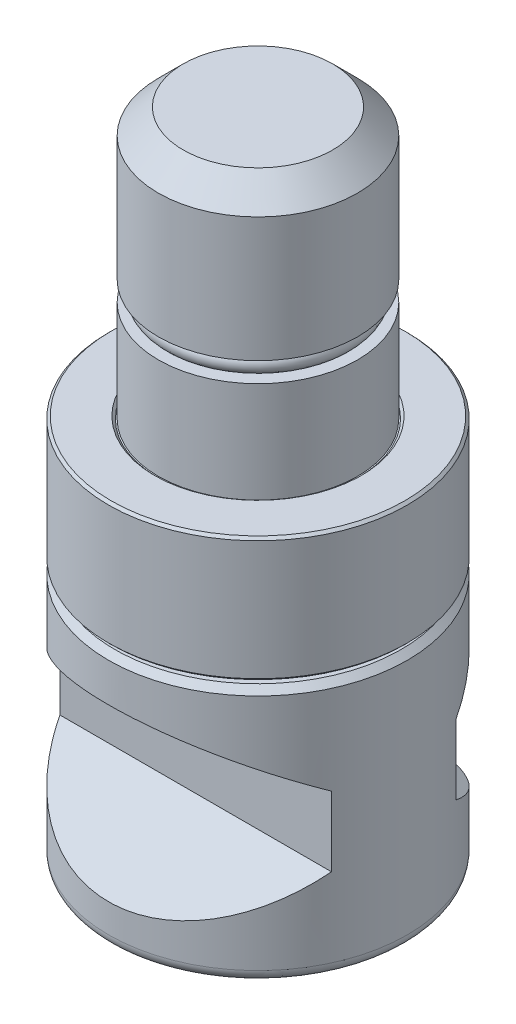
ISO-10303-21;
HEADER;
FILE_DESCRIPTION(('STEP AP214'),'2;1');
FILE_NAME('part.step','',(''),(''),'','','');
FILE_SCHEMA(('AUTOMOTIVE_DESIGN { 1 0 10303 214 1 1 1 1 }'));
ENDSEC;
DATA;
#1=APPLICATION_CONTEXT('core data for automotive mechanical design processes');
#2=APPLICATION_PROTOCOL_DEFINITION('international standard','automotive_design',2000,#1);
#3=PRODUCT_CONTEXT('',#1,'mechanical');
#4=PRODUCT('Part','Part','',(#3));
#5=PRODUCT_RELATED_PRODUCT_CATEGORY('part','',(#4));
#6=PRODUCT_DEFINITION_FORMATION('','',#4);
#7=PRODUCT_DEFINITION_CONTEXT('part definition',#1,'design');
#8=PRODUCT_DEFINITION('design','',#6,#7);
#9=PRODUCT_DEFINITION_SHAPE('','',#8);
#10=(LENGTH_UNIT() NAMED_UNIT(*) SI_UNIT(.MILLI.,.METRE.));
#11=(NAMED_UNIT(*) PLANE_ANGLE_UNIT() SI_UNIT($,.RADIAN.));
#12=(NAMED_UNIT(*) SI_UNIT($,.STERADIAN.) SOLID_ANGLE_UNIT());
#13=UNCERTAINTY_MEASURE_WITH_UNIT(LENGTH_MEASURE(1.E-05),#10,'distance_accuracy_value','');
#14=(GEOMETRIC_REPRESENTATION_CONTEXT(3) GLOBAL_UNCERTAINTY_ASSIGNED_CONTEXT((#13)) GLOBAL_UNIT_ASSIGNED_CONTEXT((#10,
#11,#12)) REPRESENTATION_CONTEXT('',''));
#15=CARTESIAN_POINT('',(0.,0.,0.));
#16=DIRECTION('',(0.,0.,1.));
#17=DIRECTION('',(1.,0.,0.));
#18=AXIS2_PLACEMENT_3D('',#15,#16,#17);
#19=CARTESIAN_POINT('',(0.,0.6,0.));
#20=DIRECTION('',(0.,1.,0.));
#21=DIRECTION('',(0.,0.,-1.));
#22=AXIS2_PLACEMENT_3D('',#19,#20,#21);
#23=TOROIDAL_SURFACE('',#22,8.6,0.6);
#24=CARTESIAN_POINT('',(0.,0.,0.));
#25=DIRECTION('',(0.,1.,0.));
#26=DIRECTION('',(0.,0.,-1.));
#27=AXIS2_PLACEMENT_3D('',#24,#25,#26);
#28=CIRCLE('',#27,8.6);
#29=CARTESIAN_POINT('',(0.,0.,-8.6));
#30=VERTEX_POINT('',#29);
#31=EDGE_CURVE('E158',#30,#30,#28,.F.);
#32=ORIENTED_EDGE('',*,*,#31,.F.);
#33=EDGE_LOOP('',(#32));
#34=FACE_BOUND('',#33,.T.);
#35=CARTESIAN_POINT('',(0.,0.5,0.));
#36=DIRECTION('',(0.,-1.,0.));
#37=DIRECTION('',(0.,0.,-1.));
#38=AXIS2_PLACEMENT_3D('',#35,#36,#37);
#39=CIRCLE('',#38,8.00839202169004);
#40=CARTESIAN_POINT('',(0.,0.5,-8.00839202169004));
#41=VERTEX_POINT('',#40);
#42=EDGE_CURVE('E10',#41,#41,#39,.F.);
#43=ORIENTED_EDGE('',*,*,#42,.F.);
#44=EDGE_LOOP('',(#43));
#45=FACE_BOUND('',#44,.T.);
#46=ADVANCED_FACE('F16',(#34,#45),#23,.F.);
#47=CARTESIAN_POINT('',(-12.,-20.6,15.));
#48=DIRECTION('',(0.,1.,0.));
#49=DIRECTION('',(1.,0.,0.));
#50=AXIS2_PLACEMENT_3D('',#47,#48,#49);
#51=PLANE('',#50);
#52=CARTESIAN_POINT('',(0.,-20.6,0.));
#53=DIRECTION('',(0.,1.,0.));
#54=DIRECTION('',(0.,0.,-1.));
#55=AXIS2_PLACEMENT_3D('',#52,#53,#54);
#56=CIRCLE('',#55,3.75);
#57=CARTESIAN_POINT('',(0.,-20.6,-3.75));
#58=VERTEX_POINT('',#57);
#59=EDGE_CURVE('E373',#58,#58,#56,.T.);
#60=ORIENTED_EDGE('',*,*,#59,.T.);
#61=EDGE_LOOP('',(#60));
#62=FACE_BOUND('',#61,.T.);
#63=CARTESIAN_POINT('',(0.,-20.6,0.));
#64=DIRECTION('',(0.,1.,0.));
#65=DIRECTION('',(1.,0.,0.));
#66=AXIS2_PLACEMENT_3D('',#63,#64,#65);
#67=CIRCLE('',#66,11.);
#68=CARTESIAN_POINT('',(11.,-20.6,0.));
#69=VERTEX_POINT('',#68);
#70=EDGE_CURVE('E106',#69,#69,#67,.F.);
#71=ORIENTED_EDGE('',*,*,#70,.T.);
#72=EDGE_LOOP('',(#71));
#73=FACE_BOUND('',#72,.T.);
#74=ADVANCED_FACE('F265',(#62,#73),#51,.F.);
#75=CARTESIAN_POINT('',(25.,-3.6,12.));
#76=DIRECTION('',(0.,0.866025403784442,-0.5));
#77=DIRECTION('',(0.,-0.5,-0.866025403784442));
#78=AXIS2_PLACEMENT_3D('',#75,#76,#77);
#79=PLANE('',#78);
#80=DIRECTION('',(-1.,0.,0.));
#81=VECTOR('',#80,1.);
#82=CARTESIAN_POINT('',(25.,-7.64145188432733,5.));
#83=LINE('',#82,#81);
#84=CARTESIAN_POINT('',(10.9087121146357,-7.64145188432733,5.));
#85=VERTEX_POINT('',#84);
#86=CARTESIAN_POINT('',(-10.9087121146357,-7.64145188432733,5.));
#87=VERTEX_POINT('',#86);
#88=EDGE_CURVE('E38',#85,#87,#83,.T.);
#89=ORIENTED_EDGE('',*,*,#88,.F.);
#90=CARTESIAN_POINT('',(0.,-10.5282032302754,0.));
#91=DIRECTION('',(0.,0.866025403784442,-0.5));
#92=DIRECTION('',(0.,0.5,0.866025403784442));
#93=AXIS2_PLACEMENT_3D('',#90,#91,#92);
#94=ELLIPSE('',#93,13.856406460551,12.);
#95=EDGE_CURVE('E161',#87,#85,#94,.T.);
#96=ORIENTED_EDGE('',*,*,#95,.F.);
#97=EDGE_LOOP('',(#89,#96));
#98=FACE_BOUND('',#97,.T.);
#99=ADVANCED_FACE('F272',(#98),#79,.F.);
#100=CARTESIAN_POINT('',(25.,-13.2585481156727,5.));
#101=DIRECTION('',(0.,-0.866025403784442,-0.5));
#102=DIRECTION('',(0.,-0.5,0.866025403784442));
#103=AXIS2_PLACEMENT_3D('',#100,#101,#102);
#104=PLANE('',#103);
#105=CARTESIAN_POINT('',(0.,-10.3717967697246,0.));
#106=DIRECTION('',(0.,-0.866025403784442,-0.5));
#107=DIRECTION('',(0.,0.5,-0.866025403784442));
#108=AXIS2_PLACEMENT_3D('',#105,#106,#107);
#109=ELLIPSE('',#108,13.856406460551,12.);
#110=CARTESIAN_POINT('',(10.9087121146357,-13.2585481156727,5.));
#111=VERTEX_POINT('',#110);
#112=CARTESIAN_POINT('',(-10.9087121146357,-13.2585481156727,5.));
#113=VERTEX_POINT('',#112);
#114=EDGE_CURVE('E166',#111,#113,#109,.T.);
#115=ORIENTED_EDGE('',*,*,#114,.F.);
#116=DIRECTION('',(-1.,0.,0.));
#117=VECTOR('',#116,1.);
#118=CARTESIAN_POINT('',(25.,-13.2585481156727,5.));
#119=LINE('',#118,#117);
#120=EDGE_CURVE('E31',#111,#113,#119,.T.);
#121=ORIENTED_EDGE('',*,*,#120,.T.);
#122=EDGE_LOOP('',(#115,#121));
#123=FACE_BOUND('',#122,.T.);
#124=ADVANCED_FACE('F304',(#123),#104,.F.);
#125=CARTESIAN_POINT('',(25.,-7.64145188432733,5.));
#126=DIRECTION('',(0.,0.,-1.));
#127=DIRECTION('',(-1.,0.,0.));
#128=AXIS2_PLACEMENT_3D('',#125,#126,#127);
#129=PLANE('',#128);
#130=DIRECTION('',(0.,1.,0.));
#131=VECTOR('',#130,1.);
#132=CARTESIAN_POINT('',(10.9087121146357,-20.6,5.));
#133=LINE('',#132,#131);
#134=EDGE_CURVE('E134',#85,#111,#133,.F.);
#135=ORIENTED_EDGE('',*,*,#134,.F.);
#136=ORIENTED_EDGE('',*,*,#88,.T.);
#137=DIRECTION('',(0.,1.,0.));
#138=VECTOR('',#137,1.);
#139=CARTESIAN_POINT('',(-10.9087121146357,-41.,5.));
#140=LINE('',#139,#138);
#141=EDGE_CURVE('E163',#113,#87,#140,.T.);
#142=ORIENTED_EDGE('',*,*,#141,.F.);
#143=ORIENTED_EDGE('',*,*,#120,.F.);
#144=EDGE_LOOP('',(#135,#136,#142,#143));
#145=FACE_BOUND('',#144,.T.);
#146=ADVANCED_FACE('F301',(#145),#129,.F.);
#147=CARTESIAN_POINT('',(25.,-3.6,-12.));
#148=DIRECTION('',(0.,-0.866025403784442,-0.5));
#149=DIRECTION('',(0.,-0.5,0.866025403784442));
#150=AXIS2_PLACEMENT_3D('',#147,#148,#149);
#151=PLANE('',#150);
#152=CARTESIAN_POINT('',(0.,-10.5282032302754,0.));
#153=DIRECTION('',(0.,-0.866025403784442,-0.5));
#154=DIRECTION('',(0.,0.5,-0.866025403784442));
#155=AXIS2_PLACEMENT_3D('',#152,#153,#154);
#156=ELLIPSE('',#155,13.856406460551,12.);
#157=CARTESIAN_POINT('',(-10.9087121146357,-7.64145188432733,-5.));
#158=VERTEX_POINT('',#157);
#159=CARTESIAN_POINT('',(10.9087121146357,-7.64145188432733,-5.));
#160=VERTEX_POINT('',#159);
#161=EDGE_CURVE('E175',#158,#160,#156,.T.);
#162=ORIENTED_EDGE('',*,*,#161,.T.);
#163=DIRECTION('',(-1.,0.,0.));
#164=VECTOR('',#163,1.);
#165=CARTESIAN_POINT('',(25.,-7.64145188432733,-5.));
#166=LINE('',#165,#164);
#167=EDGE_CURVE('E147',#160,#158,#166,.T.);
#168=ORIENTED_EDGE('',*,*,#167,.T.);
#169=EDGE_LOOP('',(#162,#168));
#170=FACE_BOUND('',#169,.T.);
#171=ADVANCED_FACE('F303',(#170),#151,.T.);
#172=CARTESIAN_POINT('',(25.,-7.64145188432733,-5.));
#173=DIRECTION('',(0.,0.,-1.));
#174=DIRECTION('',(-1.,0.,0.));
#175=AXIS2_PLACEMENT_3D('',#172,#173,#174);
#176=PLANE('',#175);
#177=ORIENTED_EDGE('',*,*,#167,.F.);
#178=DIRECTION('',(0.,1.,0.));
#179=VECTOR('',#178,1.);
#180=CARTESIAN_POINT('',(10.9087121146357,-20.6,-5.));
#181=LINE('',#180,#179);
#182=CARTESIAN_POINT('',(10.9087121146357,-13.2585481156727,-5.));
#183=VERTEX_POINT('',#182);
#184=EDGE_CURVE('E131',#160,#183,#181,.F.);
#185=ORIENTED_EDGE('',*,*,#184,.T.);
#186=DIRECTION('',(-1.,0.,0.));
#187=VECTOR('',#186,1.);
#188=CARTESIAN_POINT('',(25.,-13.2585481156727,-5.));
#189=LINE('',#188,#187);
#190=CARTESIAN_POINT('',(-10.9087121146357,-13.2585481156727,-5.));
#191=VERTEX_POINT('',#190);
#192=EDGE_CURVE('E146',#183,#191,#189,.T.);
#193=ORIENTED_EDGE('',*,*,#192,.T.);
#194=DIRECTION('',(0.,1.,0.));
#195=VECTOR('',#194,1.);
#196=CARTESIAN_POINT('',(-10.9087121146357,-41.,-5.));
#197=LINE('',#196,#195);
#198=EDGE_CURVE('E172',#191,#158,#197,.T.);
#199=ORIENTED_EDGE('',*,*,#198,.T.);
#200=EDGE_LOOP('',(#177,#185,#193,#199));
#201=FACE_BOUND('',#200,.T.);
#202=ADVANCED_FACE('F311',(#201),#176,.T.);
#203=CARTESIAN_POINT('',(25.,-13.2585481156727,-5.));
#204=DIRECTION('',(0.,0.866025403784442,-0.5));
#205=DIRECTION('',(0.,-0.5,-0.866025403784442));
#206=AXIS2_PLACEMENT_3D('',#203,#204,#205);
#207=PLANE('',#206);
#208=ORIENTED_EDGE('',*,*,#192,.F.);
#209=CARTESIAN_POINT('',(0.,-10.3717967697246,0.));
#210=DIRECTION('',(0.,0.866025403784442,-0.5));
#211=DIRECTION('',(0.,0.5,0.866025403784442));
#212=AXIS2_PLACEMENT_3D('',#209,#210,#211);
#213=ELLIPSE('',#212,13.856406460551,12.);
#214=EDGE_CURVE('E169',#183,#191,#213,.T.);
#215=ORIENTED_EDGE('',*,*,#214,.T.);
#216=EDGE_LOOP('',(#208,#215));
#217=FACE_BOUND('',#216,.T.);
#218=ADVANCED_FACE('F504',(#217),#207,.T.);
#219=CARTESIAN_POINT('',(0.,-19.6,0.));
#220=DIRECTION('',(0.,1.,0.));
#221=DIRECTION('',(1.,0.,0.));
#222=AXIS2_PLACEMENT_3D('',#219,#220,#221);
#223=TOROIDAL_SURFACE('',#222,11.,1.);
#224=ORIENTED_EDGE('',*,*,#70,.F.);
#225=EDGE_LOOP('',(#224));
#226=FACE_BOUND('',#225,.T.);
#227=CARTESIAN_POINT('',(0.,-19.6,0.));
#228=DIRECTION('',(0.,1.,0.));
#229=DIRECTION('',(1.,0.,0.));
#230=AXIS2_PLACEMENT_3D('',#227,#228,#229);
#231=CIRCLE('',#230,12.);
#232=CARTESIAN_POINT('',(12.,-19.6,0.));
#233=VERTEX_POINT('',#232);
#234=EDGE_CURVE('E183',#233,#233,#231,.T.);
#235=ORIENTED_EDGE('',*,*,#234,.F.);
#236=EDGE_LOOP('',(#235));
#237=FACE_BOUND('',#236,.T.);
#238=ADVANCED_FACE('F18',(#226,#237),#223,.T.);
#239=CARTESIAN_POINT('',(0.,-41.,0.));
#240=DIRECTION('',(0.,1.,0.));
#241=DIRECTION('',(0.,0.,-1.));
#242=AXIS2_PLACEMENT_3D('',#239,#240,#241);
#243=CYLINDRICAL_SURFACE('',#242,12.);
#244=ORIENTED_EDGE('',*,*,#234,.T.);
#245=EDGE_LOOP('',(#244));
#246=FACE_BOUND('',#245,.T.);
#247=CARTESIAN_POINT('',(0.,-0.5,0.));
#248=DIRECTION('',(0.,1.,0.));
#249=DIRECTION('',(0.,0.,-1.));
#250=AXIS2_PLACEMENT_3D('',#247,#248,#249);
#251=CIRCLE('',#250,12.);
#252=CARTESIAN_POINT('',(0.,-0.499999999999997,-12.));
#253=VERTEX_POINT('',#252);
#254=EDGE_CURVE('E177',#253,#253,#251,.F.);
#255=ORIENTED_EDGE('',*,*,#254,.T.);
#256=EDGE_LOOP('',(#255));
#257=FACE_BOUND('',#256,.T.);
#258=ORIENTED_EDGE('',*,*,#214,.F.);
#259=ORIENTED_EDGE('',*,*,#184,.F.);
#260=ORIENTED_EDGE('',*,*,#161,.F.);
#261=ORIENTED_EDGE('',*,*,#198,.F.);
#262=EDGE_LOOP('',(#258,#259,#260,#261));
#263=FACE_BOUND('',#262,.T.);
#264=ORIENTED_EDGE('',*,*,#134,.T.);
#265=ORIENTED_EDGE('',*,*,#114,.T.);
#266=ORIENTED_EDGE('',*,*,#141,.T.);
#267=ORIENTED_EDGE('',*,*,#95,.T.);
#268=EDGE_LOOP('',(#264,#265,#266,#267));
#269=FACE_BOUND('',#268,.T.);
#270=ADVANCED_FACE('F282',(#246,#257,#263,#269),#243,.T.);
#271=CARTESIAN_POINT('',(0.,-0.5,0.));
#272=DIRECTION('',(0.,-1.,0.));
#273=DIRECTION('',(0.,0.,1.));
#274=AXIS2_PLACEMENT_3D('',#271,#272,#273);
#275=CONICAL_SURFACE('',#274,12.,0.785398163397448);
#276=CARTESIAN_POINT('',(0.,0.,0.));
#277=DIRECTION('',(0.,1.,0.));
#278=DIRECTION('',(0.,0.,-1.));
#279=AXIS2_PLACEMENT_3D('',#276,#277,#278);
#280=CIRCLE('',#279,11.5);
#281=CARTESIAN_POINT('',(0.,0.,-11.5));
#282=VERTEX_POINT('',#281);
#283=EDGE_CURVE('E180',#282,#282,#280,.T.);
#284=ORIENTED_EDGE('',*,*,#283,.F.);
#285=EDGE_LOOP('',(#284));
#286=FACE_BOUND('',#285,.T.);
#287=ORIENTED_EDGE('',*,*,#254,.F.);
#288=EDGE_LOOP('',(#287));
#289=FACE_BOUND('',#288,.T.);
#290=ADVANCED_FACE('F280',(#286,#289),#275,.T.);
#291=CARTESIAN_POINT('',(0.,0.,0.));
#292=DIRECTION('',(0.,1.,0.));
#293=DIRECTION('',(0.,0.,-1.));
#294=AXIS2_PLACEMENT_3D('',#291,#292,#293);
#295=PLANE('',#294);
#296=ORIENTED_EDGE('',*,*,#283,.T.);
#297=EDGE_LOOP('',(#296));
#298=FACE_BOUND('',#297,.T.);
#299=ORIENTED_EDGE('',*,*,#31,.T.);
#300=EDGE_LOOP('',(#299));
#301=FACE_BOUND('',#300,.T.);
#302=ADVANCED_FACE('F203',(#298,#301),#295,.T.);
#303=CARTESIAN_POINT('',(0.,-20.6,0.));
#304=DIRECTION('',(0.,-1.,0.));
#305=DIRECTION('',(0.,0.,1.));
#306=AXIS2_PLACEMENT_3D('',#303,#304,#305);
#307=CONICAL_SURFACE('',#306,3.75,1.0471975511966);
#308=ORIENTED_EDGE('',*,*,#59,.F.);
#309=EDGE_LOOP('',(#308));
#310=FACE_BOUND('',#309,.T.);
#311=CARTESIAN_POINT('',(0.00019999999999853,-20.4350031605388,-3.4642170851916));
#312=CARTESIAN_POINT('',(-0.131635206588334,-20.3910410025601,-3.38810199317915));
#313=CARTESIAN_POINT('',(-0.264608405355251,-20.3510588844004,-3.31132988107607));
#314=CARTESIAN_POINT('',(-0.532857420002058,-20.2812693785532,-3.15645624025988));
#315=CARTESIAN_POINT('',(-0.668138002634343,-20.2514866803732,-3.078351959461));
#316=CARTESIAN_POINT('',(-0.937022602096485,-20.205125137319,-2.92311136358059));
#317=CARTESIAN_POINT('',(-1.07058524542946,-20.1882377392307,-2.84599893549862));
#318=CARTESIAN_POINT('',(-1.3383390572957,-20.1680769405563,-2.6914112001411));
#319=CARTESIAN_POINT('',(-1.47252925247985,-20.1647868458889,-2.61393645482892));
#320=CARTESIAN_POINT('',(-1.72327559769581,-20.1716278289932,-2.46916798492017));
#321=CARTESIAN_POINT('',(-1.83986926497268,-20.1800792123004,-2.40185259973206));
#322=CARTESIAN_POINT('',(-2.07229698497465,-20.2068662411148,-2.2676603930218));
#323=CARTESIAN_POINT('',(-2.18813023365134,-20.2252110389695,-2.2007840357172));
#324=CARTESIAN_POINT('',(-2.42103725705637,-20.2710720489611,-2.06631510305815));
#325=CARTESIAN_POINT('',(-2.53808155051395,-20.2987826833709,-1.99873954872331));
#326=CARTESIAN_POINT('',(-2.77042435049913,-20.3616750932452,-1.86459637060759));
#327=CARTESIAN_POINT('',(-2.88572583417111,-20.3968420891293,-1.79802702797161));
#328=CARTESIAN_POINT('',(-3.0002,-20.4350031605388,-1.73193533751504));
#329=B_SPLINE_CURVE_WITH_KNOTS('',3,(#311,#312,#313,#314,#315,#316,#317,#318,#319,#320,#321,
#322,#323,#324,#325,#326,#327,#328),.UNSPECIFIED.,.F.,.F.,(4,2,2,2,2,2,2,2,4),(0.,
0.475539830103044,0.952222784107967,1.41710776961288,1.88142182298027,2.28572436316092,
2.69040156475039,3.10405572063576,3.51689749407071),.UNSPECIFIED.);
#330=CARTESIAN_POINT('',(0.,-20.4349364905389,-3.46410161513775));
#331=VERTEX_POINT('',#330);
#332=CARTESIAN_POINT('',(-3.,-20.4349364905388,-1.73205080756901));
#333=VERTEX_POINT('',#332);
#334=EDGE_CURVE('E97',#331,#333,#329,.T.);
#335=ORIENTED_EDGE('',*,*,#334,.T.);
#336=CARTESIAN_POINT('',(-3.,-21.9126261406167,-5.22331081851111));
#337=CARTESIAN_POINT('',(-3.,-21.8500953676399,-5.09839207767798));
#338=CARTESIAN_POINT('',(-3.,-21.7879936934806,-4.9732562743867));
#339=CARTESIAN_POINT('',(-3.,-21.6648581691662,-4.72245581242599));
#340=CARTESIAN_POINT('',(-3.,-21.6038243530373,-4.59679113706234));
#341=CARTESIAN_POINT('',(-3.,-21.4829170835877,-4.34459355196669));
#342=CARTESIAN_POINT('',(-3.,-21.4230462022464,-4.21805940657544));
#343=CARTESIAN_POINT('',(-3.,-21.3048773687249,-3.9642550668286));
#344=CARTESIAN_POINT('',(-3.,-21.2465794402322,-3.8369848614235));
#345=CARTESIAN_POINT('',(-3.,-21.1293314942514,-3.57579973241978));
#346=CARTESIAN_POINT('',(-3.,-21.0704710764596,-3.44184445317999));
#347=CARTESIAN_POINT('',(-3.,-20.9554163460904,-3.17279497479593));
#348=CARTESIAN_POINT('',(-3.,-20.8992219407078,-3.03770081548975));
#349=CARTESIAN_POINT('',(-3.,-20.7902586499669,-2.76625064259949));
#350=CARTESIAN_POINT('',(-3.,-20.737487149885,-2.62989568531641));
#351=CARTESIAN_POINT('',(-3.,-20.6362580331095,-2.35554255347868));
#352=CARTESIAN_POINT('',(-3.,-20.5878016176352,-2.21754393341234));
#353=CARTESIAN_POINT('',(-3.,-20.4858075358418,-1.90736941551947));
#354=CARTESIAN_POINT('',(-3.,-20.4337102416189,-1.73471109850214));
#355=CARTESIAN_POINT('',(-3.,-20.3409165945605,-1.38639576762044));
#356=CARTESIAN_POINT('',(-3.,-20.3002135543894,-1.21074057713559));
#357=CARTESIAN_POINT('',(-3.,-20.2341754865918,-0.859535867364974));
#358=CARTESIAN_POINT('',(-3.,-20.2085934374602,-0.684034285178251));
#359=CARTESIAN_POINT('',(-3.,-20.1746384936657,-0.331383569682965));
#360=CARTESIAN_POINT('',(-3.,-20.1662581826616,-0.15423517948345));
#361=CARTESIAN_POINT('',(-3.,-20.1678218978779,0.201072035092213));
#362=CARTESIAN_POINT('',(-3.,-20.1778793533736,0.379230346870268));
#363=CARTESIAN_POINT('',(-3.,-20.2151890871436,0.733747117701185));
#364=CARTESIAN_POINT('',(-3.,-20.2424494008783,0.910104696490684));
#365=CARTESIAN_POINT('',(-3.,-20.311721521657,1.26294952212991));
#366=CARTESIAN_POINT('',(-3.,-20.3539781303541,1.4393871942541));
#367=CARTESIAN_POINT('',(-3.,-20.4496812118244,1.78923874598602));
#368=CARTESIAN_POINT('',(-3.,-20.5031340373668,1.96265084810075));
#369=CARTESIAN_POINT('',(-3.,-20.6063214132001,2.2709104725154));
#370=CARTESIAN_POINT('',(-3.,-20.6545194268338,2.40628172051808));
#371=CARTESIAN_POINT('',(-3.,-20.7549625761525,2.67546504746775));
#372=CARTESIAN_POINT('',(-3.,-20.8072065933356,2.80927754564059));
#373=CARTESIAN_POINT('',(-3.,-20.9149156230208,3.07570061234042));
#374=CARTESIAN_POINT('',(-3.,-20.9703828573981,3.20831027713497));
#375=CARTESIAN_POINT('',(-3.,-21.0838418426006,3.47244628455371));
#376=CARTESIAN_POINT('',(-3.,-21.1418336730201,3.60397259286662));
#377=CARTESIAN_POINT('',(-3.,-21.2573189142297,3.86053084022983));
#378=CARTESIAN_POINT('',(-3.,-21.3147282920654,3.98560072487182));
#379=CARTESIAN_POINT('',(-3.,-21.4310518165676,4.23503512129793));
#380=CARTESIAN_POINT('',(-3.,-21.4899659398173,4.35939964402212));
#381=CARTESIAN_POINT('',(-3.,-21.6089223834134,4.60731081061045));
#382=CARTESIAN_POINT('',(-3.,-21.6689624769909,4.73085852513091));
#383=CARTESIAN_POINT('',(-3.,-21.7900719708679,4.97744444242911));
#384=CARTESIAN_POINT('',(-3.,-21.8511413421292,5.10048265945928));
#385=CARTESIAN_POINT('',(-3.,-21.9126261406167,5.22331081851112));
#386=B_SPLINE_CURVE_WITH_KNOTS('',3,(#336,#337,#338,#339,#340,#341,#342,#343,#344,#345,#346,
#347,#348,#349,#350,#351,#352,#353,#354,#355,#356,#357,#358,#359,#360,#361,#362,#363,#364,#365,
#366,#367,#368,#369,#370,#371,#372,#373,#374,#375,#376,#377,#378,#379,#380,#381,#382,#383,#384,
#385),.UNSPECIFIED.,.F.,.F.,(4,2,2,2,2,2,2,2,2,2,2,2,2,2,2,2,2,2,2,2,2,2,2,2,4),(0.,
0.419088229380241,0.838189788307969,1.25813167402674,1.67807988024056,2.11700693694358,
2.55591870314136,2.99449114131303,3.4331852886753,3.97393590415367,4.51436848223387,
5.04570917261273,5.57682073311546,6.11121066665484,6.64585039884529,7.18965267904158,
7.73376435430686,8.16477855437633,8.59567402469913,9.02687013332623,9.45807984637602,
9.87091765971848,10.2837490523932,10.6958357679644,11.1079108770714),.UNSPECIFIED.);
#387=CARTESIAN_POINT('',(-3.,-20.4349364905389,1.73205080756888));
#388=VERTEX_POINT('',#387);
#389=EDGE_CURVE('E117',#333,#388,#386,.T.);
#390=ORIENTED_EDGE('',*,*,#389,.T.);
#391=CARTESIAN_POINT('',(-3.0002,-20.4350031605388,1.73193533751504));
#392=CARTESIAN_POINT('',(-2.86836479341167,-20.3910410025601,1.80805042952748));
#393=CARTESIAN_POINT('',(-2.73539159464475,-20.3510588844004,1.88482254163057));
#394=CARTESIAN_POINT('',(-2.46714257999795,-20.2812693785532,2.03969618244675));
#395=CARTESIAN_POINT('',(-2.33186199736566,-20.2514866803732,2.11780046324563));
#396=CARTESIAN_POINT('',(-2.06297739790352,-20.205125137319,2.27304105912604));
#397=CARTESIAN_POINT('',(-1.92941475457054,-20.1882377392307,2.35015348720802));
#398=CARTESIAN_POINT('',(-1.66166094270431,-20.1680769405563,2.50474122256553));
#399=CARTESIAN_POINT('',(-1.52747074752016,-20.1647868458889,2.58221596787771));
#400=CARTESIAN_POINT('',(-1.27672440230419,-20.1716278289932,2.72698443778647));
#401=CARTESIAN_POINT('',(-1.16013073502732,-20.1800792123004,2.79429982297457));
#402=CARTESIAN_POINT('',(-0.927703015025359,-20.2068662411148,2.92849202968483));
#403=CARTESIAN_POINT('',(-0.811869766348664,-20.2252110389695,2.99536838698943));
#404=CARTESIAN_POINT('',(-0.578962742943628,-20.2710720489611,3.12983731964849));
#405=CARTESIAN_POINT('',(-0.461918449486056,-20.2987826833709,3.19741287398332));
#406=CARTESIAN_POINT('',(-0.229575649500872,-20.3616750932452,3.33155605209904));
#407=CARTESIAN_POINT('',(-0.114274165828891,-20.3968420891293,3.39812539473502));
#408=CARTESIAN_POINT('',(0.000200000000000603,-20.4350031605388,3.4642170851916));
#409=B_SPLINE_CURVE_WITH_KNOTS('',3,(#391,#392,#393,#394,#395,#396,#397,#398,#399,#400,#401,
#402,#403,#404,#405,#406,#407,#408),.UNSPECIFIED.,.F.,.F.,(4,2,2,2,2,2,2,2,4),(0.,
0.475539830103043,0.952222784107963,1.41710776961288,1.88142182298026,2.28572436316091,
2.69040156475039,3.10405572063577,3.51689749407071),.UNSPECIFIED.);
#410=CARTESIAN_POINT('',(0.,-20.4349364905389,3.46410161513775));
#411=VERTEX_POINT('',#410);
#412=EDGE_CURVE('E227',#388,#411,#409,.T.);
#413=ORIENTED_EDGE('',*,*,#412,.T.);
#414=CARTESIAN_POINT('',(-0.00019999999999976,-20.4350031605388,3.4642170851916));
#415=CARTESIAN_POINT('',(0.131635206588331,-20.3910410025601,3.38810199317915));
#416=CARTESIAN_POINT('',(0.264608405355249,-20.3510588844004,3.31132988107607));
#417=CARTESIAN_POINT('',(0.532857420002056,-20.2812693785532,3.15645624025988));
#418=CARTESIAN_POINT('',(0.668138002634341,-20.2514866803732,3.078351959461));
#419=CARTESIAN_POINT('',(0.937022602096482,-20.205125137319,2.92311136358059));
#420=CARTESIAN_POINT('',(1.07058524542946,-20.1882377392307,2.84599893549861));
#421=CARTESIAN_POINT('',(1.33833905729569,-20.1680769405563,2.6914112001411));
#422=CARTESIAN_POINT('',(1.47252925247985,-20.1647868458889,2.61393645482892));
#423=CARTESIAN_POINT('',(1.72327559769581,-20.1716278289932,2.46916798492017));
#424=CARTESIAN_POINT('',(1.83986926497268,-20.1800792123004,2.40185259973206));
#425=CARTESIAN_POINT('',(2.07229698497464,-20.2068662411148,2.2676603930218));
#426=CARTESIAN_POINT('',(2.18813023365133,-20.2252110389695,2.2007840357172));
#427=CARTESIAN_POINT('',(2.42103725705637,-20.2710720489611,2.06631510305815));
#428=CARTESIAN_POINT('',(2.53808155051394,-20.2987826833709,1.99873954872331));
#429=CARTESIAN_POINT('',(2.77042435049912,-20.3616750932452,1.86459637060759));
#430=CARTESIAN_POINT('',(2.88572583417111,-20.3968420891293,1.79802702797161));
#431=CARTESIAN_POINT('',(3.0002,-20.4350031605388,1.73193533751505));
#432=B_SPLINE_CURVE_WITH_KNOTS('',3,(#414,#415,#416,#417,#418,#419,#420,#421,#422,#423,#424,
#425,#426,#427,#428,#429,#430,#431),.UNSPECIFIED.,.F.,.F.,(4,2,2,2,2,2,2,2,4),(0.,
0.475539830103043,0.952222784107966,1.41710776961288,1.88142182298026,2.28572436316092,
2.69040156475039,3.10405572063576,3.5168974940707),.UNSPECIFIED.);
#433=CARTESIAN_POINT('',(3.,-20.4349364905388,1.73205080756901));
#434=VERTEX_POINT('',#433);
#435=EDGE_CURVE('E220',#411,#434,#432,.T.);
#436=ORIENTED_EDGE('',*,*,#435,.T.);
#437=CARTESIAN_POINT('',(3.,-21.9126261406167,5.22331081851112));
#438=CARTESIAN_POINT('',(3.,-21.8500953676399,5.09839207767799));
#439=CARTESIAN_POINT('',(3.,-21.7879936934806,4.97325627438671));
#440=CARTESIAN_POINT('',(3.,-21.6648581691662,4.72245581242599));
#441=CARTESIAN_POINT('',(3.,-21.6038243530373,4.59679113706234));
#442=CARTESIAN_POINT('',(3.,-21.4829170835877,4.3445935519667));
#443=CARTESIAN_POINT('',(3.,-21.4230462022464,4.21805940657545));
#444=CARTESIAN_POINT('',(3.,-21.3048773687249,3.96425506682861));
#445=CARTESIAN_POINT('',(3.,-21.2465794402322,3.8369848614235));
#446=CARTESIAN_POINT('',(3.,-21.1293314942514,3.57579973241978));
#447=CARTESIAN_POINT('',(3.,-21.0704710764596,3.44184445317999));
#448=CARTESIAN_POINT('',(3.,-20.9554163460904,3.17279497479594));
#449=CARTESIAN_POINT('',(3.,-20.8992219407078,3.03770081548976));
#450=CARTESIAN_POINT('',(3.,-20.7902586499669,2.7662506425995));
#451=CARTESIAN_POINT('',(3.,-20.737487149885,2.62989568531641));
#452=CARTESIAN_POINT('',(3.,-20.6362580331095,2.35554255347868));
#453=CARTESIAN_POINT('',(3.,-20.5878016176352,2.21754393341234));
#454=CARTESIAN_POINT('',(3.,-20.4858075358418,1.90736941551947));
#455=CARTESIAN_POINT('',(3.,-20.4337102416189,1.73471109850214));
#456=CARTESIAN_POINT('',(3.,-20.3409165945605,1.38639576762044));
#457=CARTESIAN_POINT('',(3.,-20.3002135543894,1.21074057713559));
#458=CARTESIAN_POINT('',(3.,-20.2341754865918,0.859535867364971));
#459=CARTESIAN_POINT('',(3.,-20.2085934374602,0.684034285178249));
#460=CARTESIAN_POINT('',(3.,-20.1746384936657,0.331383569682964));
#461=CARTESIAN_POINT('',(3.,-20.1662581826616,0.154235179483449));
#462=CARTESIAN_POINT('',(3.,-20.1678218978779,-0.201072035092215));
#463=CARTESIAN_POINT('',(3.,-20.1778793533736,-0.379230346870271));
#464=CARTESIAN_POINT('',(3.,-20.2151890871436,-0.73374711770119));
#465=CARTESIAN_POINT('',(3.,-20.2424494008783,-0.91010469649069));
#466=CARTESIAN_POINT('',(3.,-20.311721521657,-1.26294952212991));
#467=CARTESIAN_POINT('',(3.,-20.3539781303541,-1.43938719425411));
#468=CARTESIAN_POINT('',(3.,-20.4496812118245,-1.78923874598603));
#469=CARTESIAN_POINT('',(3.,-20.5031340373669,-1.96265084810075));
#470=CARTESIAN_POINT('',(3.,-20.6063214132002,-2.27091047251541));
#471=CARTESIAN_POINT('',(3.,-20.6545194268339,-2.4062817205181));
#472=CARTESIAN_POINT('',(3.,-20.7549625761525,-2.67546504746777));
#473=CARTESIAN_POINT('',(3.,-20.8072065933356,-2.80927754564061));
#474=CARTESIAN_POINT('',(3.,-20.9149156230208,-3.07570061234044));
#475=CARTESIAN_POINT('',(3.,-20.9703828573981,-3.20831027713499));
#476=CARTESIAN_POINT('',(3.,-21.0838418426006,-3.47244628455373));
#477=CARTESIAN_POINT('',(3.,-21.1418336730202,-3.60397259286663));
#478=CARTESIAN_POINT('',(3.,-21.2573189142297,-3.86053084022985));
#479=CARTESIAN_POINT('',(3.,-21.3147282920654,-3.98560072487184));
#480=CARTESIAN_POINT('',(3.,-21.4310518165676,-4.23503512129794));
#481=CARTESIAN_POINT('',(3.,-21.4899659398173,-4.35939964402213));
#482=CARTESIAN_POINT('',(3.,-21.6089223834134,-4.60731081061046));
#483=CARTESIAN_POINT('',(3.,-21.6689624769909,-4.73085852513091));
#484=CARTESIAN_POINT('',(3.,-21.7900719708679,-4.97744444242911));
#485=CARTESIAN_POINT('',(3.,-21.8511413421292,-5.10048265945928));
#486=CARTESIAN_POINT('',(3.,-21.9126261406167,-5.22331081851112));
#487=B_SPLINE_CURVE_WITH_KNOTS('',3,(#437,#438,#439,#440,#441,#442,#443,#444,#445,#446,#447,
#448,#449,#450,#451,#452,#453,#454,#455,#456,#457,#458,#459,#460,#461,#462,#463,#464,#465,#466,
#467,#468,#469,#470,#471,#472,#473,#474,#475,#476,#477,#478,#479,#480,#481,#482,#483,#484,#485,
#486),.UNSPECIFIED.,.F.,.F.,(4,2,2,2,2,2,2,2,2,2,2,2,2,2,2,2,2,2,2,2,2,2,2,2,4),(0.,
0.419088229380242,0.838189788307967,1.25813167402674,1.67807988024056,2.11700693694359,
2.55591870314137,2.99449114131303,3.4331852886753,3.97393590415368,4.51436848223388,
5.04570917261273,5.57682073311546,6.11121066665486,6.6458503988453,7.1896526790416,
7.73376435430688,8.16477855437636,8.59567402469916,9.02687013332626,9.45807984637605,
9.8709176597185,10.2837490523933,10.6958357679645,11.1079108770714),.UNSPECIFIED.);
#488=CARTESIAN_POINT('',(3.,-20.4349364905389,-1.73205080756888));
#489=VERTEX_POINT('',#488);
#490=EDGE_CURVE('E100',#434,#489,#487,.T.);
#491=ORIENTED_EDGE('',*,*,#490,.T.);
#492=CARTESIAN_POINT('',(3.0002,-20.4350031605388,-1.73193533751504));
#493=CARTESIAN_POINT('',(2.86836479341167,-20.3910410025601,-1.80805042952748));
#494=CARTESIAN_POINT('',(2.73539159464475,-20.3510588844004,-1.88482254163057));
#495=CARTESIAN_POINT('',(2.46714257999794,-20.2812693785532,-2.03969618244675));
#496=CARTESIAN_POINT('',(2.33186199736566,-20.2514866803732,-2.11780046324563));
#497=CARTESIAN_POINT('',(2.06297739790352,-20.205125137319,-2.27304105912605));
#498=CARTESIAN_POINT('',(1.92941475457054,-20.1882377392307,-2.35015348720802));
#499=CARTESIAN_POINT('',(1.66166094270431,-20.1680769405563,-2.50474122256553));
#500=CARTESIAN_POINT('',(1.52747074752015,-20.1647868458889,-2.58221596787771));
#501=CARTESIAN_POINT('',(1.27672440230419,-20.1716278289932,-2.72698443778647));
#502=CARTESIAN_POINT('',(1.16013073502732,-20.1800792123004,-2.79429982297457));
#503=CARTESIAN_POINT('',(0.927703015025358,-20.2068662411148,-2.92849202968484));
#504=CARTESIAN_POINT('',(0.811869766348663,-20.2252110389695,-2.99536838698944));
#505=CARTESIAN_POINT('',(0.578962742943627,-20.2710720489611,-3.12983731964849));
#506=CARTESIAN_POINT('',(0.461918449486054,-20.2987826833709,-3.19741287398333));
#507=CARTESIAN_POINT('',(0.229575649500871,-20.3616750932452,-3.33155605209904));
#508=CARTESIAN_POINT('',(0.11427416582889,-20.3968420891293,-3.39812539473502));
#509=CARTESIAN_POINT('',(-0.000200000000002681,-20.4350031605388,-3.4642170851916));
#510=B_SPLINE_CURVE_WITH_KNOTS('',3,(#492,#493,#494,#495,#496,#497,#498,#499,#500,#501,#502,
#503,#504,#505,#506,#507,#508,#509),.UNSPECIFIED.,.F.,.F.,(4,2,2,2,2,2,2,2,4),(0.,
0.475539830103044,0.952222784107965,1.41710776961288,1.88142182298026,2.28572436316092,
2.69040156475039,3.10405572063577,3.51689749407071),.UNSPECIFIED.);
#511=EDGE_CURVE('E94',#489,#331,#510,.T.);
#512=ORIENTED_EDGE('',*,*,#511,.T.);
#513=EDGE_LOOP('',(#335,#390,#413,#436,#491,#512));
#514=FACE_BOUND('',#513,.T.);
#515=ADVANCED_FACE('F96',(#310,#514),#307,.F.);
#516=CARTESIAN_POINT('',(0.,-16.1,0.));
#517=DIRECTION('',(0.,-1.,0.));
#518=DIRECTION('',(0.,0.,1.));
#519=AXIS2_PLACEMENT_3D('',#516,#517,#518);
#520=PLANE('',#519);
#521=DIRECTION('',(0.,0.,1.));
#522=VECTOR('',#521,1.);
#523=CARTESIAN_POINT('',(3.,-16.1,-1.73205080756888));
#524=LINE('',#523,#522);
#525=CARTESIAN_POINT('',(3.,-16.1,-1.73205080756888));
#526=VERTEX_POINT('',#525);
#527=CARTESIAN_POINT('',(3.,-16.1,1.73205080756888));
#528=VERTEX_POINT('',#527);
#529=EDGE_CURVE('E395',#526,#528,#524,.T.);
#530=ORIENTED_EDGE('',*,*,#529,.T.);
#531=DIRECTION('',(-0.866025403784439,0.,0.5));
#532=VECTOR('',#531,1.);
#533=CARTESIAN_POINT('',(3.,-16.1,1.73205080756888));
#534=LINE('',#533,#532);
#535=CARTESIAN_POINT('',(0.,-16.1,3.46410161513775));
#536=VERTEX_POINT('',#535);
#537=EDGE_CURVE('E393',#528,#536,#534,.T.);
#538=ORIENTED_EDGE('',*,*,#537,.T.);
#539=DIRECTION('',(-0.866025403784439,0.,-0.5));
#540=VECTOR('',#539,1.);
#541=CARTESIAN_POINT('',(0.,-16.1,3.46410161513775));
#542=LINE('',#541,#540);
#543=CARTESIAN_POINT('',(-3.,-16.1,1.73205080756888));
#544=VERTEX_POINT('',#543);
#545=EDGE_CURVE('E127',#536,#544,#542,.T.);
#546=ORIENTED_EDGE('',*,*,#545,.T.);
#547=DIRECTION('',(0.,0.,-1.));
#548=VECTOR('',#547,1.);
#549=CARTESIAN_POINT('',(-3.,-16.1,1.73205080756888));
#550=LINE('',#549,#548);
#551=CARTESIAN_POINT('',(-3.,-16.1,-1.73205080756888));
#552=VERTEX_POINT('',#551);
#553=EDGE_CURVE('E123',#544,#552,#550,.T.);
#554=ORIENTED_EDGE('',*,*,#553,.T.);
#555=DIRECTION('',(0.866025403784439,0.,-0.5));
#556=VECTOR('',#555,1.);
#557=CARTESIAN_POINT('',(-3.,-16.1,-1.73205080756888));
#558=LINE('',#557,#556);
#559=CARTESIAN_POINT('',(0.,-16.1,-3.46410161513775));
#560=VERTEX_POINT('',#559);
#561=EDGE_CURVE('E116',#552,#560,#558,.T.);
#562=ORIENTED_EDGE('',*,*,#561,.T.);
#563=DIRECTION('',(0.866025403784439,0.,0.5));
#564=VECTOR('',#563,1.);
#565=CARTESIAN_POINT('',(0.,-16.1,-3.46410161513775));
#566=LINE('',#565,#564);
#567=EDGE_CURVE('E120',#560,#526,#566,.T.);
#568=ORIENTED_EDGE('',*,*,#567,.T.);
#569=EDGE_LOOP('',(#530,#538,#546,#554,#562,#568));
#570=FACE_BOUND('',#569,.T.);
#571=ADVANCED_FACE('F202',(#570),#520,.T.);
#572=CARTESIAN_POINT('',(0.,-16.1,-3.46410161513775));
#573=DIRECTION('',(0.5,0.,-0.866025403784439));
#574=DIRECTION('',(-0.866025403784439,0.,-0.5));
#575=AXIS2_PLACEMENT_3D('',#572,#573,#574);
#576=PLANE('',#575);
#577=ORIENTED_EDGE('',*,*,#511,.F.);
#578=DIRECTION('',(0.,-1.,0.));
#579=VECTOR('',#578,1.);
#580=CARTESIAN_POINT('',(3.,-16.1,-1.73205080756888));
#581=LINE('',#580,#579);
#582=EDGE_CURVE('E122',#526,#489,#581,.T.);
#583=ORIENTED_EDGE('',*,*,#582,.F.);
#584=ORIENTED_EDGE('',*,*,#567,.F.);
#585=DIRECTION('',(0.,-1.,0.));
#586=VECTOR('',#585,1.);
#587=CARTESIAN_POINT('',(0.,-16.1,-3.46410161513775));
#588=LINE('',#587,#586);
#589=EDGE_CURVE('E113',#560,#331,#588,.T.);
#590=ORIENTED_EDGE('',*,*,#589,.T.);
#591=EDGE_LOOP('',(#577,#583,#584,#590));
#592=FACE_BOUND('',#591,.T.);
#593=ADVANCED_FACE('F119',(#592),#576,.F.);
#594=CARTESIAN_POINT('',(3.,-16.1,-1.73205080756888));
#595=DIRECTION('',(1.,0.,0.));
#596=DIRECTION('',(0.,-1.,0.));
#597=AXIS2_PLACEMENT_3D('',#594,#595,#596);
#598=PLANE('',#597);
#599=ORIENTED_EDGE('',*,*,#490,.F.);
#600=DIRECTION('',(0.,-1.,0.));
#601=VECTOR('',#600,1.);
#602=CARTESIAN_POINT('',(3.,-16.1,1.73205080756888));
#603=LINE('',#602,#601);
#604=EDGE_CURVE('E125',#528,#434,#603,.T.);
#605=ORIENTED_EDGE('',*,*,#604,.F.);
#606=ORIENTED_EDGE('',*,*,#529,.F.);
#607=ORIENTED_EDGE('',*,*,#582,.T.);
#608=EDGE_LOOP('',(#599,#605,#606,#607));
#609=FACE_BOUND('',#608,.T.);
#610=ADVANCED_FACE('F254',(#609),#598,.F.);
#611=CARTESIAN_POINT('',(3.,-16.1,1.73205080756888));
#612=DIRECTION('',(0.5,0.,0.866025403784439));
#613=DIRECTION('',(0.866025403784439,0.,-0.5));
#614=AXIS2_PLACEMENT_3D('',#611,#612,#613);
#615=PLANE('',#614);
#616=ORIENTED_EDGE('',*,*,#435,.F.);
#617=DIRECTION('',(0.,-1.,0.));
#618=VECTOR('',#617,1.);
#619=CARTESIAN_POINT('',(0.,-16.1,3.46410161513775));
#620=LINE('',#619,#618);
#621=EDGE_CURVE('E384',#536,#411,#620,.T.);
#622=ORIENTED_EDGE('',*,*,#621,.F.);
#623=ORIENTED_EDGE('',*,*,#537,.F.);
#624=ORIENTED_EDGE('',*,*,#604,.T.);
#625=EDGE_LOOP('',(#616,#622,#623,#624));
#626=FACE_BOUND('',#625,.T.);
#627=ADVANCED_FACE('F250',(#626),#615,.F.);
#628=CARTESIAN_POINT('',(0.,-16.1,3.46410161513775));
#629=DIRECTION('',(-0.5,0.,0.866025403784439));
#630=DIRECTION('',(0.866025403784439,0.,0.5));
#631=AXIS2_PLACEMENT_3D('',#628,#629,#630);
#632=PLANE('',#631);
#633=ORIENTED_EDGE('',*,*,#412,.F.);
#634=DIRECTION('',(0.,-1.,0.));
#635=VECTOR('',#634,1.);
#636=CARTESIAN_POINT('',(-3.,-16.1,1.73205080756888));
#637=LINE('',#636,#635);
#638=EDGE_CURVE('E387',#544,#388,#637,.T.);
#639=ORIENTED_EDGE('',*,*,#638,.F.);
#640=ORIENTED_EDGE('',*,*,#545,.F.);
#641=ORIENTED_EDGE('',*,*,#621,.T.);
#642=EDGE_LOOP('',(#633,#639,#640,#641));
#643=FACE_BOUND('',#642,.T.);
#644=ADVANCED_FACE('F246',(#643),#632,.F.);
#645=CARTESIAN_POINT('',(-3.,-16.1,1.73205080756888));
#646=DIRECTION('',(-1.,0.,0.));
#647=DIRECTION('',(0.,1.,0.));
#648=AXIS2_PLACEMENT_3D('',#645,#646,#647);
#649=PLANE('',#648);
#650=ORIENTED_EDGE('',*,*,#389,.F.);
#651=DIRECTION('',(0.,-1.,0.));
#652=VECTOR('',#651,1.);
#653=CARTESIAN_POINT('',(-3.,-16.1,-1.73205080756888));
#654=LINE('',#653,#652);
#655=EDGE_CURVE('E115',#552,#333,#654,.T.);
#656=ORIENTED_EDGE('',*,*,#655,.F.);
#657=ORIENTED_EDGE('',*,*,#553,.F.);
#658=ORIENTED_EDGE('',*,*,#638,.T.);
#659=EDGE_LOOP('',(#650,#656,#657,#658));
#660=FACE_BOUND('',#659,.T.);
#661=ADVANCED_FACE('F243',(#660),#649,.F.);
#662=CARTESIAN_POINT('',(-3.,-16.1,-1.73205080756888));
#663=DIRECTION('',(-0.5,0.,-0.866025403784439));
#664=DIRECTION('',(-0.866025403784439,0.,0.5));
#665=AXIS2_PLACEMENT_3D('',#662,#663,#664);
#666=PLANE('',#665);
#667=ORIENTED_EDGE('',*,*,#334,.F.);
#668=ORIENTED_EDGE('',*,*,#589,.F.);
#669=ORIENTED_EDGE('',*,*,#561,.F.);
#670=ORIENTED_EDGE('',*,*,#655,.T.);
#671=EDGE_LOOP('',(#667,#668,#669,#670));
#672=FACE_BOUND('',#671,.T.);
#673=ADVANCED_FACE('F111',(#672),#666,.F.);
#674=CARTESIAN_POINT('',(0.,0.5,0.));
#675=DIRECTION('',(0.,1.,0.));
#676=DIRECTION('',(0.,0.,1.));
#677=AXIS2_PLACEMENT_3D('',#674,#675,#676);
#678=PLANE('',#677);
#679=CARTESIAN_POINT('',(0.,0.5,0.));
#680=DIRECTION('',(0.,-1.,0.));
#681=DIRECTION('',(0.,0.,-1.));
#682=AXIS2_PLACEMENT_3D('',#679,#680,#681);
#683=CIRCLE('',#682,11.8);
#684=CARTESIAN_POINT('',(0.,0.5,-11.8));
#685=VERTEX_POINT('',#684);
#686=EDGE_CURVE('E550',#685,#685,#683,.T.);
#687=ORIENTED_EDGE('',*,*,#686,.T.);
#688=EDGE_LOOP('',(#687));
#689=FACE_BOUND('',#688,.T.);
#690=ORIENTED_EDGE('',*,*,#42,.T.);
#691=EDGE_LOOP('',(#690));
#692=FACE_BOUND('',#691,.T.);
#693=ADVANCED_FACE('F357',(#689,#692),#678,.F.);
#694=CARTESIAN_POINT('',(0.,10.5,0.));
#695=DIRECTION('',(0.,-1.,0.));
#696=DIRECTION('',(0.,0.,-1.));
#697=AXIS2_PLACEMENT_3D('',#694,#695,#696);
#698=CYLINDRICAL_SURFACE('',#697,12.);
#699=CARTESIAN_POINT('',(0.,0.7,0.));
#700=DIRECTION('',(0.,-1.,0.));
#701=DIRECTION('',(0.,0.,-1.));
#702=AXIS2_PLACEMENT_3D('',#699,#700,#701);
#703=CIRCLE('',#702,12.);
#704=CARTESIAN_POINT('',(0.,0.7,-12.));
#705=VERTEX_POINT('',#704);
#706=EDGE_CURVE('E369',#705,#705,#703,.F.);
#707=ORIENTED_EDGE('',*,*,#706,.T.);
#708=EDGE_LOOP('',(#707));
#709=FACE_BOUND('',#708,.T.);
#710=CARTESIAN_POINT('',(0.,10.3,0.));
#711=DIRECTION('',(0.,1.,0.));
#712=DIRECTION('',(0.,0.,1.));
#713=AXIS2_PLACEMENT_3D('',#710,#711,#712);
#714=CIRCLE('',#713,12.);
#715=CARTESIAN_POINT('',(0.,10.3,12.));
#716=VERTEX_POINT('',#715);
#717=EDGE_CURVE('E556',#716,#716,#714,.F.);
#718=ORIENTED_EDGE('',*,*,#717,.T.);
#719=EDGE_LOOP('',(#718));
#720=FACE_BOUND('',#719,.T.);
#721=ADVANCED_FACE('F359',(#709,#720),#698,.T.);
#722=CARTESIAN_POINT('',(8.1,10.5,0.));
#723=DIRECTION('',(0.,1.,0.));
#724=DIRECTION('',(0.,0.,1.));
#725=AXIS2_PLACEMENT_3D('',#722,#723,#724);
#726=PLANE('',#725);
#727=CARTESIAN_POINT('',(0.,10.5,0.));
#728=DIRECTION('',(0.,1.,0.));
#729=DIRECTION('',(0.,0.,1.));
#730=AXIS2_PLACEMENT_3D('',#727,#728,#729);
#731=CIRCLE('',#730,11.8);
#732=CARTESIAN_POINT('',(0.,10.5,11.8));
#733=VERTEX_POINT('',#732);
#734=EDGE_CURVE('E553',#733,#733,#731,.T.);
#735=ORIENTED_EDGE('',*,*,#734,.T.);
#736=EDGE_LOOP('',(#735));
#737=FACE_BOUND('',#736,.T.);
#738=CARTESIAN_POINT('',(0.,10.5,0.));
#739=DIRECTION('',(0.,1.,0.));
#740=DIRECTION('',(0.,0.,1.));
#741=AXIS2_PLACEMENT_3D('',#738,#739,#740);
#742=CIRCLE('',#741,8.3);
#743=CARTESIAN_POINT('',(0.,10.5,8.3));
#744=VERTEX_POINT('',#743);
#745=EDGE_CURVE('E564',#744,#744,#742,.F.);
#746=ORIENTED_EDGE('',*,*,#745,.T.);
#747=EDGE_LOOP('',(#746));
#748=FACE_BOUND('',#747,.T.);
#749=ADVANCED_FACE('F568',(#737,#748),#726,.T.);
#750=CARTESIAN_POINT('',(0.,10.5,0.));
#751=DIRECTION('',(0.,1.,0.));
#752=DIRECTION('',(0.,0.,1.));
#753=AXIS2_PLACEMENT_3D('',#750,#751,#752);
#754=CONICAL_SURFACE('',#753,8.3,0.785398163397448);
#755=CARTESIAN_POINT('',(0.,10.3,0.));
#756=DIRECTION('',(0.,1.,0.));
#757=DIRECTION('',(0.,0.,1.));
#758=AXIS2_PLACEMENT_3D('',#755,#756,#757);
#759=CIRCLE('',#758,8.1);
#760=CARTESIAN_POINT('',(0.,10.3,8.1));
#761=VERTEX_POINT('',#760);
#762=EDGE_CURVE('E561',#761,#761,#759,.T.);
#763=ORIENTED_EDGE('',*,*,#762,.F.);
#764=EDGE_LOOP('',(#763));
#765=FACE_BOUND('',#764,.T.);
#766=ORIENTED_EDGE('',*,*,#745,.F.);
#767=EDGE_LOOP('',(#766));
#768=FACE_BOUND('',#767,.T.);
#769=ADVANCED_FACE('F346',(#765,#768),#754,.F.);
#770=CARTESIAN_POINT('',(0.,10.3,0.));
#771=DIRECTION('',(0.,-1.,0.));
#772=DIRECTION('',(0.,0.,-1.));
#773=AXIS2_PLACEMENT_3D('',#770,#771,#772);
#774=CONICAL_SURFACE('',#773,12.,0.785398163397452);
#775=ORIENTED_EDGE('',*,*,#734,.F.);
#776=EDGE_LOOP('',(#775));
#777=FACE_BOUND('',#776,.T.);
#778=ORIENTED_EDGE('',*,*,#717,.F.);
#779=EDGE_LOOP('',(#778));
#780=FACE_BOUND('',#779,.T.);
#781=ADVANCED_FACE('F335',(#777,#780),#774,.T.);
#782=CARTESIAN_POINT('',(0.,0.5,0.));
#783=DIRECTION('',(0.,1.,0.));
#784=DIRECTION('',(0.,0.,1.));
#785=AXIS2_PLACEMENT_3D('',#782,#783,#784);
#786=CONICAL_SURFACE('',#785,11.8,0.785398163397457);
#787=ORIENTED_EDGE('',*,*,#706,.F.);
#788=EDGE_LOOP('',(#787));
#789=FACE_BOUND('',#788,.T.);
#790=ORIENTED_EDGE('',*,*,#686,.F.);
#791=EDGE_LOOP('',(#790));
#792=FACE_BOUND('',#791,.T.);
#793=ADVANCED_FACE('F327',(#789,#792),#786,.T.);
#794=CARTESIAN_POINT('',(0.,32.,0.));
#795=DIRECTION('',(0.,1.,0.));
#796=DIRECTION('',(0.,0.,-1.));
#797=AXIS2_PLACEMENT_3D('',#794,#795,#796);
#798=PLANE('',#797);
#799=CARTESIAN_POINT('',(0.,32.,0.));
#800=DIRECTION('',(0.,1.,0.));
#801=DIRECTION('',(0.,0.,-1.));
#802=AXIS2_PLACEMENT_3D('',#799,#800,#801);
#803=CIRCLE('',#802,6.);
#804=CARTESIAN_POINT('',(0.,32.,-6.));
#805=VERTEX_POINT('',#804);
#806=EDGE_CURVE('E155',#805,#805,#803,.T.);
#807=ORIENTED_EDGE('',*,*,#806,.T.);
#808=EDGE_LOOP('',(#807));
#809=FACE_BOUND('',#808,.T.);
#810=ADVANCED_FACE('F325',(#809),#798,.T.);
#811=CARTESIAN_POINT('',(0.,30.,0.));
#812=DIRECTION('',(0.,-1.,0.));
#813=DIRECTION('',(0.,0.,1.));
#814=AXIS2_PLACEMENT_3D('',#811,#812,#813);
#815=CONICAL_SURFACE('',#814,8.,0.78539816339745);
#816=ORIENTED_EDGE('',*,*,#806,.F.);
#817=EDGE_LOOP('',(#816));
#818=FACE_BOUND('',#817,.T.);
#819=CARTESIAN_POINT('',(0.,30.,0.));
#820=DIRECTION('',(0.,1.,0.));
#821=DIRECTION('',(0.,0.,-1.));
#822=AXIS2_PLACEMENT_3D('',#819,#820,#821);
#823=CIRCLE('',#822,8.);
#824=CARTESIAN_POINT('',(0.,30.,-8.));
#825=VERTEX_POINT('',#824);
#826=EDGE_CURVE('E151',#825,#825,#823,.F.);
#827=ORIENTED_EDGE('',*,*,#826,.F.);
#828=EDGE_LOOP('',(#827));
#829=FACE_BOUND('',#828,.T.);
#830=ADVANCED_FACE('F278',(#818,#829),#815,.T.);
#831=CARTESIAN_POINT('',(0.,0.,0.));
#832=DIRECTION('',(0.,-1.,0.));
#833=DIRECTION('',(0.,0.,1.));
#834=AXIS2_PLACEMENT_3D('',#831,#832,#833);
#835=CYLINDRICAL_SURFACE('',#834,8.);
#836=CARTESIAN_POINT('',(0.,20.,0.));
#837=DIRECTION('',(0.,-1.,0.));
#838=DIRECTION('',(0.,0.,1.));
#839=AXIS2_PLACEMENT_3D('',#836,#837,#838);
#840=CIRCLE('',#839,8.);
#841=CARTESIAN_POINT('',(0.,20.,8.));
#842=VERTEX_POINT('',#841);
#843=EDGE_CURVE('E140',#842,#842,#840,.T.);
#844=ORIENTED_EDGE('',*,*,#843,.F.);
#845=EDGE_LOOP('',(#844));
#846=FACE_BOUND('',#845,.T.);
#847=ORIENTED_EDGE('',*,*,#826,.T.);
#848=EDGE_LOOP('',(#847));
#849=FACE_BOUND('',#848,.T.);
#850=ADVANCED_FACE('F320',(#846,#849),#835,.T.);
#851=CARTESIAN_POINT('',(-6.,20.,0.));
#852=DIRECTION('',(0.,1.,0.));
#853=DIRECTION('',(0.,0.,-1.));
#854=AXIS2_PLACEMENT_3D('',#851,#852,#853);
#855=PLANE('',#854);
#856=CARTESIAN_POINT('',(0.,20.,0.));
#857=DIRECTION('',(0.,-1.,0.));
#858=DIRECTION('',(0.,0.,1.));
#859=AXIS2_PLACEMENT_3D('',#856,#857,#858);
#860=CIRCLE('',#859,6.);
#861=CARTESIAN_POINT('',(0.,20.,6.));
#862=VERTEX_POINT('',#861);
#863=EDGE_CURVE('E137',#862,#862,#860,.T.);
#864=ORIENTED_EDGE('',*,*,#863,.F.);
#865=EDGE_LOOP('',(#864));
#866=FACE_BOUND('',#865,.T.);
#867=ORIENTED_EDGE('',*,*,#843,.T.);
#868=EDGE_LOOP('',(#867));
#869=FACE_BOUND('',#868,.T.);
#870=ADVANCED_FACE('F322',(#866,#869),#855,.F.);
#871=CARTESIAN_POINT('',(0.,0.,0.));
#872=DIRECTION('',(0.,-1.,0.));
#873=DIRECTION('',(0.,0.,1.));
#874=AXIS2_PLACEMENT_3D('',#871,#872,#873);
#875=CYLINDRICAL_SURFACE('',#874,6.);
#876=ORIENTED_EDGE('',*,*,#863,.T.);
#877=EDGE_LOOP('',(#876));
#878=FACE_BOUND('',#877,.T.);
#879=CARTESIAN_POINT('',(0.,19.9,0.));
#880=DIRECTION('',(0.,-1.,0.));
#881=DIRECTION('',(0.,0.,-1.));
#882=AXIS2_PLACEMENT_3D('',#879,#880,#881);
#883=CIRCLE('',#882,6.);
#884=CARTESIAN_POINT('',(0.,19.9,-6.));
#885=VERTEX_POINT('',#884);
#886=EDGE_CURVE('E25',#885,#885,#883,.T.);
#887=ORIENTED_EDGE('',*,*,#886,.F.);
#888=EDGE_LOOP('',(#887));
#889=FACE_BOUND('',#888,.T.);
#890=ADVANCED_FACE('F521',(#878,#889),#875,.T.);
#891=CARTESIAN_POINT('',(6.,19.9,0.));
#892=DIRECTION('',(0.,-1.,0.));
#893=DIRECTION('',(0.,0.,-1.));
#894=AXIS2_PLACEMENT_3D('',#891,#892,#893);
#895=PLANE('',#894);
#896=ORIENTED_EDGE('',*,*,#886,.T.);
#897=EDGE_LOOP('',(#896));
#898=FACE_BOUND('',#897,.T.);
#899=CARTESIAN_POINT('',(0.,19.9,0.));
#900=DIRECTION('',(0.,-1.,0.));
#901=DIRECTION('',(0.,0.,-1.));
#902=AXIS2_PLACEMENT_3D('',#899,#900,#901);
#903=CIRCLE('',#902,6.75);
#904=CARTESIAN_POINT('',(0.,19.9,-6.75));
#905=VERTEX_POINT('',#904);
#906=EDGE_CURVE('E371',#905,#905,#903,.F.);
#907=ORIENTED_EDGE('',*,*,#906,.T.);
#908=EDGE_LOOP('',(#907));
#909=FACE_BOUND('',#908,.T.);
#910=ADVANCED_FACE('F205',(#898,#909),#895,.F.);
#911=CARTESIAN_POINT('',(6.75,19.15,0.));
#912=DIRECTION('',(0.,0.,1.));
#913=DIRECTION('',(0.,1.,0.));
#914=AXIS2_PLACEMENT_3D('',#911,#912,#913);
#915=ELLIPSE('',#914,0.75,0.75);
#916=CARTESIAN_POINT('',(0.,19.15,0.));
#917=DIRECTION('',(0.,-1.,0.));
#918=AXIS1_PLACEMENT('',#916,#917);
#919=SURFACE_OF_REVOLUTION('',#915,#918);
#920=ORIENTED_EDGE('',*,*,#906,.F.);
#921=EDGE_LOOP('',(#920));
#922=FACE_BOUND('',#921,.T.);
#923=CARTESIAN_POINT('',(0.,18.4,0.));
#924=DIRECTION('',(0.,-1.,0.));
#925=DIRECTION('',(0.,0.,-1.));
#926=AXIS2_PLACEMENT_3D('',#923,#924,#925);
#927=CIRCLE('',#926,6.75);
#928=CARTESIAN_POINT('',(0.,18.4,-6.75));
#929=VERTEX_POINT('',#928);
#930=EDGE_CURVE('E105',#929,#929,#927,.F.);
#931=ORIENTED_EDGE('',*,*,#930,.T.);
#932=EDGE_LOOP('',(#931));
#933=FACE_BOUND('',#932,.T.);
#934=ADVANCED_FACE('F361',(#922,#933),#919,.F.);
#935=CARTESIAN_POINT('',(-6.,18.4,0.));
#936=DIRECTION('',(0.,-1.,0.));
#937=DIRECTION('',(0.,0.,1.));
#938=AXIS2_PLACEMENT_3D('',#935,#936,#937);
#939=PLANE('',#938);
#940=ORIENTED_EDGE('',*,*,#930,.F.);
#941=EDGE_LOOP('',(#940));
#942=FACE_BOUND('',#941,.T.);
#943=CARTESIAN_POINT('',(0.,18.4,0.));
#944=DIRECTION('',(0.,-1.,0.));
#945=DIRECTION('',(0.,0.,1.));
#946=AXIS2_PLACEMENT_3D('',#943,#944,#945);
#947=CIRCLE('',#946,8.);
#948=CARTESIAN_POINT('',(0.,18.4,8.));
#949=VERTEX_POINT('',#948);
#950=EDGE_CURVE('E143',#949,#949,#947,.T.);
#951=ORIENTED_EDGE('',*,*,#950,.F.);
#952=EDGE_LOOP('',(#951));
#953=FACE_BOUND('',#952,.T.);
#954=ADVANCED_FACE('F364',(#942,#953),#939,.F.);
#955=ORIENTED_EDGE('',*,*,#950,.T.);
#956=EDGE_LOOP('',(#955));
#957=FACE_BOUND('',#956,.T.);
#958=CARTESIAN_POINT('',(0.,10.3,0.));
#959=DIRECTION('',(0.,-1.,0.));
#960=DIRECTION('',(0.,0.,-1.));
#961=AXIS2_PLACEMENT_3D('',#958,#959,#960);
#962=CIRCLE('',#961,8.);
#963=CARTESIAN_POINT('',(0.,10.3,-8.));
#964=VERTEX_POINT('',#963);
#965=EDGE_CURVE('E20',#964,#964,#962,.F.);
#966=ORIENTED_EDGE('',*,*,#965,.T.);
#967=EDGE_LOOP('',(#966));
#968=FACE_BOUND('',#967,.T.);
#969=ADVANCED_FACE('F324',(#957,#968),#835,.T.);
#970=CARTESIAN_POINT('',(0.,10.3,0.));
#971=DIRECTION('',(0.,-1.,0.));
#972=DIRECTION('',(0.,0.,-1.));
#973=AXIS2_PLACEMENT_3D('',#970,#971,#972);
#974=PLANE('',#973);
#975=ORIENTED_EDGE('',*,*,#965,.F.);
#976=EDGE_LOOP('',(#975));
#977=FACE_BOUND('',#976,.T.);
#978=ORIENTED_EDGE('',*,*,#762,.T.);
#979=EDGE_LOOP('',(#978));
#980=FACE_BOUND('',#979,.T.);
#981=ADVANCED_FACE('F353',(#977,#980),#974,.F.);
#982=CLOSED_SHELL('',(#46,#74,#99,#124,#146,#171,#202,#218,#238,#270,#290,#302,#515,#571,#593,
#610,#627,#644,#661,#673,#693,#721,#749,#769,#781,#793,#810,#830,#850,#870,#890,#910,#934,#954,
#969,#981));
#983=MANIFOLD_SOLID_BREP('B1',#982);
#984=ADVANCED_BREP_SHAPE_REPRESENTATION('',(#18,#983),#14);
#985=SHAPE_DEFINITION_REPRESENTATION(#9,#984);
ENDSEC;
END-ISO-10303-21;
